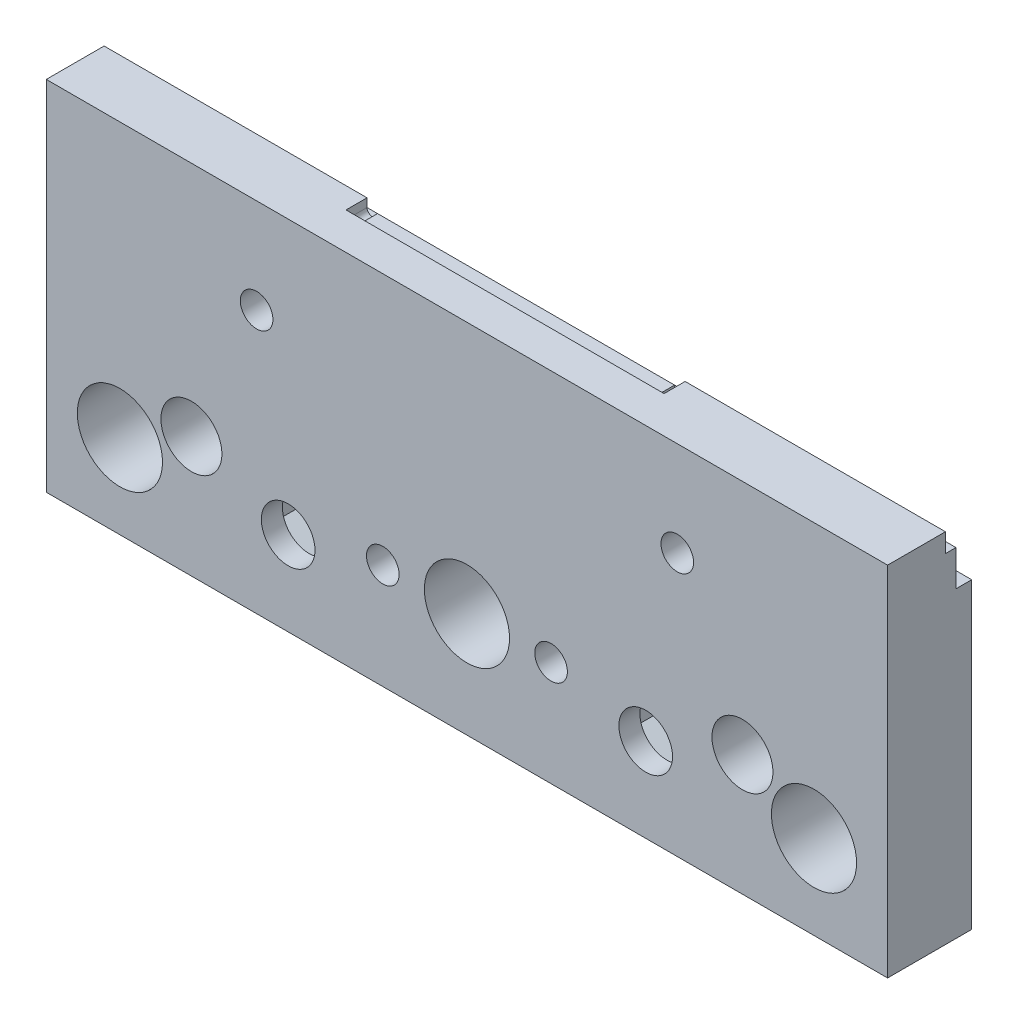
from build123d import *

# Parameters (mm, degrees)
SKETCH_2_W           = 80
SKETCH_2_H           = 34
SKETCH_2_R           = 4.05
EXTRUDE_1_DEPTH      = 8
SKETCH_3_R           = 2.55
CUT_EXTRUDE_1_DEPTH  = 88.292611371
CUT_EXTRUDE_2_DEPTH  = 88.292611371
SKETCH_5_R           = 1.55
CUT_EXTRUDE_3_DEPTH  = 88.292611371
CUT_EXTRUDE_15_DEPTH = 4.5
SKETCH_11_R          = 1.55
CUT_EXTRUDE_7_DEPTH  = 88.292611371
CUT_EXTRUDE_11_DEPTH = 2
SKETCH_21_R          = 2.9
CUT_EXTRUDE_13_DEPTH = 88.292611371
CUT_EXTRUDE_14_DEPTH = 6


with BuildPart() as part:
    # Sketch 2 → Extrude 1 (new body)
    with BuildSketch(Plane.XY):
        with Locations((40, 17)):
            Rectangle(SKETCH_2_W, SKETCH_2_H)
        with Locations((7, 8)):
            Circle(SKETCH_2_R, mode=Mode.SUBTRACT)
        with Locations((40, 10)):
            Circle(SKETCH_2_R, mode=Mode.SUBTRACT)
        with Locations((73, 8)):
            Circle(SKETCH_2_R, mode=Mode.SUBTRACT)
    extrude(amount=EXTRUDE_1_DEPTH)

    # Sketch 3 → Cut-Extrude 1 (cut, through all)
    with BuildSketch(Plane.XY.offset(8)):
        with Locations((23, 8)):
            Circle(SKETCH_3_R)
        with Locations((57, 8)):
            Circle(SKETCH_3_R)
    extrude(amount=-CUT_EXTRUDE_1_DEPTH, mode=Mode.SUBTRACT)

    # Sketch 4 → Cut-Extrude 2 (cut, through all)
    with BuildSketch(Plane(origin=(80, 0, 0), x_dir=(0, 0, -1), z_dir=(1, 0, 0))):
        Polygon((-1.5, 32.2), (-2.5, 32.2), (-2.5, 34), (0, 34), (0, 28.8), (-1.5, 28.8), align=None)
    extrude(amount=-CUT_EXTRUDE_2_DEPTH, mode=Mode.SUBTRACT)

    # Sketch 5 → Cut-Extrude 3 (cut, through all)
    with BuildSketch(Plane.XY.offset(8)):
        with Locations((48, 10)):
            Circle(SKETCH_5_R)
        with Locations((32, 10)):
            Circle(SKETCH_5_R)
    extrude(amount=-CUT_EXTRUDE_3_DEPTH, mode=Mode.SUBTRACT)

    # Sketch 8 → Cut-Extrude 15 (cut)
    with BuildSketch(Plane(origin=(0, 0, 0), x_dir=(-1, 0, 0), z_dir=(0, 0, -1))):
        Polygon((-48, 6.709103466), (-45.15, 8.354551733), (-45.15, 11.645448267), (-48, 13.290896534), (-50.85, 11.645448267), (-50.85, 8.354551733), align=None)
        Polygon((-34.85, 11.645448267), (-34.85, 8.354551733), (-32, 6.709103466), (-29.15, 8.354551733), (-29.15, 11.645448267), (-32, 13.290896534), align=None)
    extrude(amount=-CUT_EXTRUDE_15_DEPTH, mode=Mode.SUBTRACT)

    # Sketch 11 → Cut-Extrude 7 (cut, through all)
    with BuildSketch(Plane(origin=(0, 0, 0), x_dir=(-1, 0, 0), z_dir=(0, 0, -1))):
        with Locations((-60, 25)):
            Circle(SKETCH_11_R)
        with Locations((-20, 25)):
            Circle(SKETCH_11_R)
    extrude(amount=-CUT_EXTRUDE_7_DEPTH, mode=Mode.SUBTRACT)

    # Sketch 19 → Cut-Extrude 11 (cut)
    with BuildSketch(Plane(origin=(0, 0, 2.5), x_dir=(-1, 0, 0), z_dir=(0, 0, -1))):
        with BuildLine():
            Line((-25, 34), (-55.247938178, 34))
            Line((-55.247938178, 34), (-55.247938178, 33.2))
            ThreePointArc((-55.247938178, 33.2), (-54.747938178, 32.7), (-54.247938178, 33.2))
            Line((-54.247938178, 33.2), (-26, 33.2))
            ThreePointArc((-26, 33.2), (-25.5, 32.7), (-25, 33.2))
            Line((-25, 33.2), (-25, 34))
        make_face()
    extrude(amount=-CUT_EXTRUDE_11_DEPTH, mode=Mode.SUBTRACT)

    # Sketch 21 → Cut-Extrude 13 (cut, through all)
    with BuildSketch(Plane(origin=(0, 0, 0), x_dir=(-1, 0, 0), z_dir=(0, 0, -1))):
        with Locations((-66.2, 11.5)):
            Circle(SKETCH_21_R)
        with Locations(Location((-13.8, 11.5, 0), (0, 0, 180))):
            Circle(SKETCH_21_R)
    extrude(amount=-CUT_EXTRUDE_13_DEPTH, mode=Mode.SUBTRACT)

    # Sketch 22 → Cut-Extrude 14 (cut)
    with BuildSketch(Plane(origin=(0, 0, 0), x_dir=(-1, 0, 0), z_dir=(0, 0, -1))):
        Polygon((-52.9, 5.632863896), (-52.9, 10.367136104), (-57, 12.734272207), (-61.1, 10.367136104), (-61.1, 5.632863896), (-57, 3.265727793), align=None)
        Polygon((-23, 3.265727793), (-18.9, 5.632863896), (-18.9, 10.367136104), (-23, 12.734272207), (-27.1, 10.367136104), (-27.1, 5.632863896), align=None)
    extrude(amount=-CUT_EXTRUDE_14_DEPTH, mode=Mode.SUBTRACT)


solid = part.part
